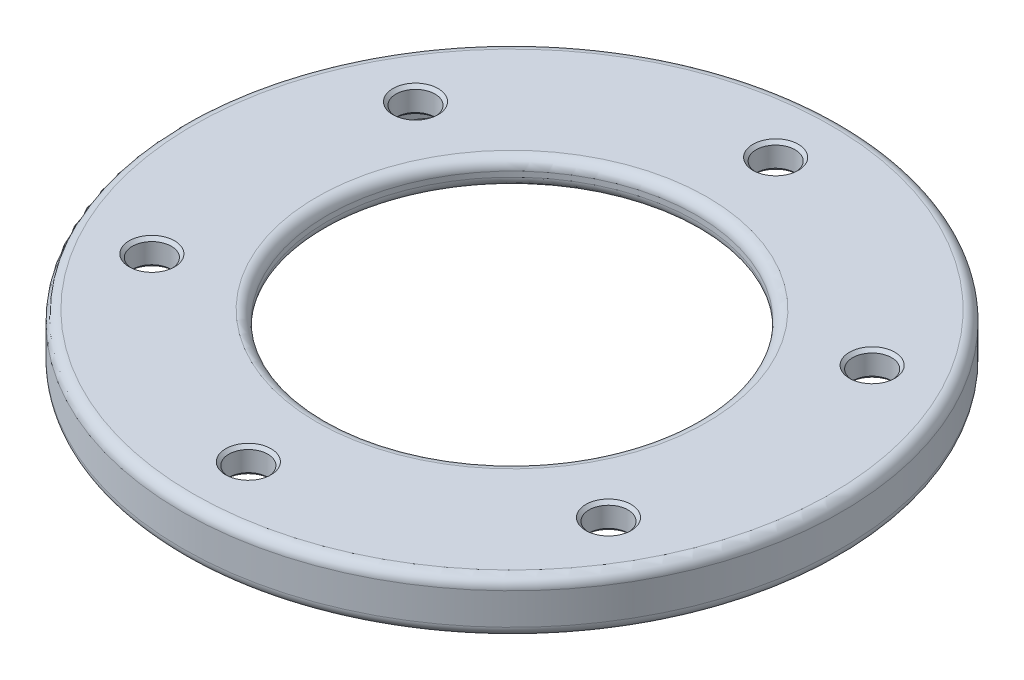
ISO-10303-21;
HEADER;
FILE_DESCRIPTION(('STEP AP214'),'2;1');
FILE_NAME('part.step','',(''),(''),'','','');
FILE_SCHEMA(('AUTOMOTIVE_DESIGN { 1 0 10303 214 1 1 1 1 }'));
ENDSEC;
DATA;
#1=APPLICATION_CONTEXT('core data for automotive mechanical design processes');
#2=APPLICATION_PROTOCOL_DEFINITION('international standard','automotive_design',2000,#1);
#3=PRODUCT_CONTEXT('',#1,'mechanical');
#4=PRODUCT('Part','Part','',(#3));
#5=PRODUCT_RELATED_PRODUCT_CATEGORY('part','',(#4));
#6=PRODUCT_DEFINITION_FORMATION('','',#4);
#7=PRODUCT_DEFINITION_CONTEXT('part definition',#1,'design');
#8=PRODUCT_DEFINITION('design','',#6,#7);
#9=PRODUCT_DEFINITION_SHAPE('','',#8);
#10=(LENGTH_UNIT() NAMED_UNIT(*) SI_UNIT(.MILLI.,.METRE.));
#11=(NAMED_UNIT(*) PLANE_ANGLE_UNIT() SI_UNIT($,.RADIAN.));
#12=(NAMED_UNIT(*) SI_UNIT($,.STERADIAN.) SOLID_ANGLE_UNIT());
#13=UNCERTAINTY_MEASURE_WITH_UNIT(LENGTH_MEASURE(1.E-05),#10,'distance_accuracy_value','');
#14=(GEOMETRIC_REPRESENTATION_CONTEXT(3) GLOBAL_UNCERTAINTY_ASSIGNED_CONTEXT((#13)) GLOBAL_UNIT_ASSIGNED_CONTEXT((#10,
#11,#12)) REPRESENTATION_CONTEXT('',''));
#15=CARTESIAN_POINT('',(0.,0.,0.));
#16=DIRECTION('',(0.,0.,1.));
#17=DIRECTION('',(1.,0.,0.));
#18=AXIS2_PLACEMENT_3D('',#15,#16,#17);
#19=CARTESIAN_POINT('',(0.,0.,0.));
#20=DIRECTION('',(0.,1.,0.));
#21=DIRECTION('',(0.,0.,1.));
#22=AXIS2_PLACEMENT_3D('',#19,#20,#21);
#23=PLANE('',#22);
#24=CARTESIAN_POINT('',(0.,0.,0.));
#25=DIRECTION('',(0.,1.,0.));
#26=DIRECTION('',(0.,0.,1.));
#27=AXIS2_PLACEMENT_3D('',#24,#25,#26);
#28=CIRCLE('',#27,23.495);
#29=CARTESIAN_POINT('',(0.,0.,23.495));
#30=VERTEX_POINT('',#29);
#31=EDGE_CURVE('E49',#30,#30,#28,.T.);
#32=ORIENTED_EDGE('',*,*,#31,.T.);
#33=EDGE_LOOP('',(#32));
#34=FACE_BOUND('',#33,.T.);
#35=CARTESIAN_POINT('',(0.,0.,-31.7499999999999));
#36=DIRECTION('',(0.,1.,0.));
#37=DIRECTION('',(0.,0.,1.));
#38=AXIS2_PLACEMENT_3D('',#35,#36,#37);
#39=CIRCLE('',#38,2.7305);
#40=CARTESIAN_POINT('',(0.,0.,-29.0194999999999));
#41=VERTEX_POINT('',#40);
#42=EDGE_CURVE('E145',#41,#41,#39,.T.);
#43=ORIENTED_EDGE('',*,*,#42,.T.);
#44=EDGE_LOOP('',(#43));
#45=FACE_BOUND('',#44,.T.);
#46=CARTESIAN_POINT('',(27.4963065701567,0.,-15.8750000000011));
#47=DIRECTION('',(0.,1.,0.));
#48=DIRECTION('',(0.,0.,1.));
#49=AXIS2_PLACEMENT_3D('',#46,#47,#48);
#50=CIRCLE('',#49,2.7305);
#51=CARTESIAN_POINT('',(27.4963065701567,0.,-13.1445000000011));
#52=VERTEX_POINT('',#51);
#53=EDGE_CURVE('E133',#52,#52,#50,.T.);
#54=ORIENTED_EDGE('',*,*,#53,.T.);
#55=EDGE_LOOP('',(#54));
#56=FACE_BOUND('',#55,.T.);
#57=CARTESIAN_POINT('',(27.496306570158,0.,15.874999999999));
#58=DIRECTION('',(0.,1.,0.));
#59=DIRECTION('',(0.,0.,1.));
#60=AXIS2_PLACEMENT_3D('',#57,#58,#59);
#61=CIRCLE('',#60,2.7305);
#62=CARTESIAN_POINT('',(27.496306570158,0.,18.605499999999));
#63=VERTEX_POINT('',#62);
#64=EDGE_CURVE('E121',#63,#63,#61,.T.);
#65=ORIENTED_EDGE('',*,*,#64,.T.);
#66=EDGE_LOOP('',(#65));
#67=FACE_BOUND('',#66,.T.);
#68=CARTESIAN_POINT('',(2.77555756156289E-12,0.,31.7500000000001));
#69=DIRECTION('',(0.,1.,0.));
#70=DIRECTION('',(0.,0.,1.));
#71=AXIS2_PLACEMENT_3D('',#68,#69,#70);
#72=CIRCLE('',#71,2.7305);
#73=CARTESIAN_POINT('',(2.77555756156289E-12,0.,34.4805000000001));
#74=VERTEX_POINT('',#73);
#75=EDGE_CURVE('E109',#74,#74,#72,.T.);
#76=ORIENTED_EDGE('',*,*,#75,.T.);
#77=EDGE_LOOP('',(#76));
#78=FACE_BOUND('',#77,.T.);
#79=CARTESIAN_POINT('',(-27.4963065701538,0.,15.8750000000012));
#80=DIRECTION('',(0.,1.,0.));
#81=DIRECTION('',(0.,0.,1.));
#82=AXIS2_PLACEMENT_3D('',#79,#80,#81);
#83=CIRCLE('',#82,2.7305);
#84=CARTESIAN_POINT('',(-27.4963065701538,0.,18.6055000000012));
#85=VERTEX_POINT('',#84);
#86=EDGE_CURVE('E97',#85,#85,#83,.T.);
#87=ORIENTED_EDGE('',*,*,#86,.T.);
#88=EDGE_LOOP('',(#87));
#89=FACE_BOUND('',#88,.T.);
#90=CARTESIAN_POINT('',(-27.4963065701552,0.,-15.8749999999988));
#91=DIRECTION('',(0.,1.,0.));
#92=DIRECTION('',(0.,0.,1.));
#93=AXIS2_PLACEMENT_3D('',#90,#91,#92);
#94=CIRCLE('',#93,2.7305);
#95=CARTESIAN_POINT('',(-27.4963065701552,0.,-13.1444999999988));
#96=VERTEX_POINT('',#95);
#97=EDGE_CURVE('E85',#96,#96,#94,.T.);
#98=ORIENTED_EDGE('',*,*,#97,.T.);
#99=EDGE_LOOP('',(#98));
#100=FACE_BOUND('',#99,.T.);
#101=CARTESIAN_POINT('',(0.,0.,0.));
#102=DIRECTION('',(0.,-1.,0.));
#103=DIRECTION('',(0.,0.,-1.));
#104=AXIS2_PLACEMENT_3D('',#101,#102,#103);
#105=CIRCLE('',#104,37.9095);
#106=CARTESIAN_POINT('',(0.,0.,-37.9095));
#107=VERTEX_POINT('',#106);
#108=EDGE_CURVE('E71',#107,#107,#105,.T.);
#109=ORIENTED_EDGE('',*,*,#108,.T.);
#110=EDGE_LOOP('',(#109));
#111=FACE_BOUND('',#110,.T.);
#112=ADVANCED_FACE('F38',(#34,#45,#56,#67,#78,#89,#100,#111),#23,.F.);
#113=CARTESIAN_POINT('',(0.,3.17500000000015,0.));
#114=DIRECTION('',(0.,1.,0.));
#115=DIRECTION('',(0.,0.,1.));
#116=AXIS2_PLACEMENT_3D('',#113,#114,#115);
#117=PLANE('',#116);
#118=CARTESIAN_POINT('',(0.,3.17500000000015,0.));
#119=DIRECTION('',(0.,1.,0.));
#120=DIRECTION('',(0.,0.,1.));
#121=AXIS2_PLACEMENT_3D('',#118,#119,#120);
#122=CIRCLE('',#121,38.4175);
#123=CARTESIAN_POINT('',(0.,3.17500000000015,38.4175));
#124=VERTEX_POINT('',#123);
#125=EDGE_CURVE('E53',#124,#124,#122,.T.);
#126=ORIENTED_EDGE('',*,*,#125,.T.);
#127=EDGE_LOOP('',(#126));
#128=FACE_BOUND('',#127,.T.);
#129=CARTESIAN_POINT('',(0.,3.17500000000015,0.));
#130=DIRECTION('',(0.,1.,0.));
#131=DIRECTION('',(0.,0.,1.));
#132=AXIS2_PLACEMENT_3D('',#129,#130,#131);
#133=CIRCLE('',#132,23.495);
#134=CARTESIAN_POINT('',(0.,3.17500000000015,23.495));
#135=VERTEX_POINT('',#134);
#136=EDGE_CURVE('E58',#135,#135,#133,.F.);
#137=ORIENTED_EDGE('',*,*,#136,.T.);
#138=EDGE_LOOP('',(#137));
#139=FACE_BOUND('',#138,.T.);
#140=CARTESIAN_POINT('',(0.,3.17500000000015,-31.7499999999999));
#141=DIRECTION('',(0.,1.,0.));
#142=DIRECTION('',(0.,0.,1.));
#143=AXIS2_PLACEMENT_3D('',#140,#141,#142);
#144=CIRCLE('',#143,2.7305);
#145=CARTESIAN_POINT('',(0.,3.17500000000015,-29.0194999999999));
#146=VERTEX_POINT('',#145);
#147=EDGE_CURVE('E142',#146,#146,#144,.T.);
#148=ORIENTED_EDGE('',*,*,#147,.F.);
#149=EDGE_LOOP('',(#148));
#150=FACE_BOUND('',#149,.T.);
#151=CARTESIAN_POINT('',(27.4963065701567,3.17500000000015,-15.8750000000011));
#152=DIRECTION('',(0.,1.,0.));
#153=DIRECTION('',(0.,0.,1.));
#154=AXIS2_PLACEMENT_3D('',#151,#152,#153);
#155=CIRCLE('',#154,2.7305);
#156=CARTESIAN_POINT('',(27.4963065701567,3.17500000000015,-13.1445000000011));
#157=VERTEX_POINT('',#156);
#158=EDGE_CURVE('E130',#157,#157,#155,.T.);
#159=ORIENTED_EDGE('',*,*,#158,.F.);
#160=EDGE_LOOP('',(#159));
#161=FACE_BOUND('',#160,.T.);
#162=CARTESIAN_POINT('',(27.496306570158,3.17500000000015,15.874999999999));
#163=DIRECTION('',(0.,1.,0.));
#164=DIRECTION('',(0.,0.,1.));
#165=AXIS2_PLACEMENT_3D('',#162,#163,#164);
#166=CIRCLE('',#165,2.7305);
#167=CARTESIAN_POINT('',(27.496306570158,3.17500000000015,18.605499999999));
#168=VERTEX_POINT('',#167);
#169=EDGE_CURVE('E118',#168,#168,#166,.T.);
#170=ORIENTED_EDGE('',*,*,#169,.F.);
#171=EDGE_LOOP('',(#170));
#172=FACE_BOUND('',#171,.T.);
#173=CARTESIAN_POINT('',(2.77555756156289E-12,3.17500000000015,31.7500000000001));
#174=DIRECTION('',(0.,1.,0.));
#175=DIRECTION('',(0.,0.,1.));
#176=AXIS2_PLACEMENT_3D('',#173,#174,#175);
#177=CIRCLE('',#176,2.7305);
#178=CARTESIAN_POINT('',(2.77555756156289E-12,3.17500000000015,34.4805000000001));
#179=VERTEX_POINT('',#178);
#180=EDGE_CURVE('E106',#179,#179,#177,.T.);
#181=ORIENTED_EDGE('',*,*,#180,.F.);
#182=EDGE_LOOP('',(#181));
#183=FACE_BOUND('',#182,.T.);
#184=CARTESIAN_POINT('',(-27.4963065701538,3.17500000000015,15.8750000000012));
#185=DIRECTION('',(0.,1.,0.));
#186=DIRECTION('',(0.,0.,1.));
#187=AXIS2_PLACEMENT_3D('',#184,#185,#186);
#188=CIRCLE('',#187,2.7305);
#189=CARTESIAN_POINT('',(-27.4963065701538,3.17500000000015,18.6055000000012));
#190=VERTEX_POINT('',#189);
#191=EDGE_CURVE('E94',#190,#190,#188,.T.);
#192=ORIENTED_EDGE('',*,*,#191,.F.);
#193=EDGE_LOOP('',(#192));
#194=FACE_BOUND('',#193,.T.);
#195=CARTESIAN_POINT('',(-27.4963065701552,3.17500000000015,-15.8749999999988));
#196=DIRECTION('',(0.,1.,0.));
#197=DIRECTION('',(0.,0.,1.));
#198=AXIS2_PLACEMENT_3D('',#195,#196,#197);
#199=CIRCLE('',#198,2.7305);
#200=CARTESIAN_POINT('',(-27.4963065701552,3.17500000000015,-13.1444999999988));
#201=VERTEX_POINT('',#200);
#202=EDGE_CURVE('E82',#201,#201,#199,.T.);
#203=ORIENTED_EDGE('',*,*,#202,.F.);
#204=EDGE_LOOP('',(#203));
#205=FACE_BOUND('',#204,.T.);
#206=ADVANCED_FACE('F171',(#128,#139,#150,#161,#172,#183,#194,#205),#117,.T.);
#207=CARTESIAN_POINT('',(0.,3.17500000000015,0.));
#208=DIRECTION('',(0.,-1.,0.));
#209=DIRECTION('',(0.,0.,-1.));
#210=AXIS2_PLACEMENT_3D('',#207,#208,#209);
#211=CYLINDRICAL_SURFACE('',#210,39.6875);
#212=CARTESIAN_POINT('',(0.,-1.90499999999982,0.));
#213=DIRECTION('',(0.,-1.,0.));
#214=DIRECTION('',(0.,0.,-1.));
#215=AXIS2_PLACEMENT_3D('',#212,#213,#214);
#216=CIRCLE('',#215,39.6875);
#217=CARTESIAN_POINT('',(0.,-1.90499999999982,-39.6875));
#218=VERTEX_POINT('',#217);
#219=EDGE_CURVE('E61',#218,#218,#216,.F.);
#220=ORIENTED_EDGE('',*,*,#219,.T.);
#221=EDGE_LOOP('',(#220));
#222=FACE_BOUND('',#221,.T.);
#223=CARTESIAN_POINT('',(0.,1.90499999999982,0.));
#224=DIRECTION('',(0.,1.,0.));
#225=DIRECTION('',(0.,0.,1.));
#226=AXIS2_PLACEMENT_3D('',#223,#224,#225);
#227=CIRCLE('',#226,39.6875);
#228=CARTESIAN_POINT('',(0.,1.90499999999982,39.6875));
#229=VERTEX_POINT('',#228);
#230=EDGE_CURVE('E64',#229,#229,#227,.F.);
#231=ORIENTED_EDGE('',*,*,#230,.T.);
#232=EDGE_LOOP('',(#231));
#233=FACE_BOUND('',#232,.T.);
#234=ADVANCED_FACE('F174',(#222,#233),#211,.T.);
#235=CARTESIAN_POINT('',(0.,3.17500000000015,0.));
#236=DIRECTION('',(0.,-1.,0.));
#237=DIRECTION('',(0.,0.,-1.));
#238=AXIS2_PLACEMENT_3D('',#235,#236,#237);
#239=CYLINDRICAL_SURFACE('',#238,22.225);
#240=CARTESIAN_POINT('',(0.,1.26999999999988,0.));
#241=DIRECTION('',(0.,1.,0.));
#242=DIRECTION('',(0.,0.,1.));
#243=AXIS2_PLACEMENT_3D('',#240,#241,#242);
#244=CIRCLE('',#243,22.225);
#245=CARTESIAN_POINT('',(0.,1.26999999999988,22.225));
#246=VERTEX_POINT('',#245);
#247=EDGE_CURVE('E10',#246,#246,#244,.F.);
#248=ORIENTED_EDGE('',*,*,#247,.T.);
#249=EDGE_LOOP('',(#248));
#250=FACE_BOUND('',#249,.T.);
#251=CARTESIAN_POINT('',(0.,1.90499999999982,0.));
#252=DIRECTION('',(0.,1.,0.));
#253=DIRECTION('',(0.,0.,1.));
#254=AXIS2_PLACEMENT_3D('',#251,#252,#253);
#255=CIRCLE('',#254,22.225);
#256=CARTESIAN_POINT('',(0.,1.90499999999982,22.225));
#257=VERTEX_POINT('',#256);
#258=EDGE_CURVE('E45',#257,#257,#255,.T.);
#259=ORIENTED_EDGE('',*,*,#258,.T.);
#260=EDGE_LOOP('',(#259));
#261=FACE_BOUND('',#260,.T.);
#262=ADVANCED_FACE('F213',(#250,#261),#239,.F.);
#263=CARTESIAN_POINT('',(0.,-3.17500000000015,0.));
#264=DIRECTION('',(0.,-1.,0.));
#265=DIRECTION('',(0.,0.,-1.));
#266=AXIS2_PLACEMENT_3D('',#263,#264,#265);
#267=PLANE('',#266);
#268=CARTESIAN_POINT('',(0.,-3.17500000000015,0.));
#269=DIRECTION('',(0.,-1.,0.));
#270=DIRECTION('',(0.,0.,-1.));
#271=AXIS2_PLACEMENT_3D('',#268,#269,#270);
#272=CIRCLE('',#271,38.4175);
#273=CARTESIAN_POINT('',(0.,-3.17500000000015,-38.4175));
#274=VERTEX_POINT('',#273);
#275=EDGE_CURVE('E67',#274,#274,#272,.T.);
#276=ORIENTED_EDGE('',*,*,#275,.T.);
#277=EDGE_LOOP('',(#276));
#278=FACE_BOUND('',#277,.T.);
#279=CARTESIAN_POINT('',(0.,-3.17500000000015,0.));
#280=DIRECTION('',(0.,-1.,0.));
#281=DIRECTION('',(0.,0.,-1.));
#282=AXIS2_PLACEMENT_3D('',#279,#280,#281);
#283=CIRCLE('',#282,37.9095);
#284=CARTESIAN_POINT('',(0.,-3.17500000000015,-37.9095));
#285=VERTEX_POINT('',#284);
#286=EDGE_CURVE('E70',#285,#285,#283,.T.);
#287=ORIENTED_EDGE('',*,*,#286,.F.);
#288=EDGE_LOOP('',(#287));
#289=FACE_BOUND('',#288,.T.);
#290=ADVANCED_FACE('F412',(#278,#289),#267,.T.);
#291=CARTESIAN_POINT('',(0.,-3.17500000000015,0.));
#292=DIRECTION('',(0.,1.,0.));
#293=DIRECTION('',(0.,0.,1.));
#294=AXIS2_PLACEMENT_3D('',#291,#292,#293);
#295=CYLINDRICAL_SURFACE('',#294,37.9095);
#296=ORIENTED_EDGE('',*,*,#286,.T.);
#297=EDGE_LOOP('',(#296));
#298=FACE_BOUND('',#297,.T.);
#299=ORIENTED_EDGE('',*,*,#108,.F.);
#300=EDGE_LOOP('',(#299));
#301=FACE_BOUND('',#300,.T.);
#302=ADVANCED_FACE('F402',(#298,#301),#295,.F.);
#303=CARTESIAN_POINT('',(-27.4963065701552,0.380999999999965,-15.8749999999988));
#304=DIRECTION('',(0.,-1.,0.));
#305=DIRECTION('',(0.,0.,-1.));
#306=AXIS2_PLACEMENT_3D('',#303,#304,#305);
#307=CONICAL_SURFACE('',#306,2.3495,0.785398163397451);
#308=ORIENTED_EDGE('',*,*,#97,.F.);
#309=EDGE_LOOP('',(#308));
#310=FACE_BOUND('',#309,.T.);
#311=CARTESIAN_POINT('',(-27.4963065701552,0.380999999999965,-15.8749999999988));
#312=DIRECTION('',(0.,1.,0.));
#313=DIRECTION('',(0.,0.,1.));
#314=AXIS2_PLACEMENT_3D('',#311,#312,#313);
#315=CIRCLE('',#314,2.3495);
#316=CARTESIAN_POINT('',(-27.4963065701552,0.380999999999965,-13.5254999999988));
#317=VERTEX_POINT('',#316);
#318=EDGE_CURVE('E74',#317,#317,#315,.T.);
#319=ORIENTED_EDGE('',*,*,#318,.T.);
#320=EDGE_LOOP('',(#319));
#321=FACE_BOUND('',#320,.T.);
#322=ADVANCED_FACE('F200',(#310,#321),#307,.F.);
#323=CARTESIAN_POINT('',(-27.4963065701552,3.17500000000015,-15.8749999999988));
#324=DIRECTION('',(0.,1.,0.));
#325=DIRECTION('',(0.,0.,1.));
#326=AXIS2_PLACEMENT_3D('',#323,#324,#325);
#327=CYLINDRICAL_SURFACE('',#326,2.3495);
#328=ORIENTED_EDGE('',*,*,#318,.F.);
#329=EDGE_LOOP('',(#328));
#330=FACE_BOUND('',#329,.T.);
#331=CARTESIAN_POINT('',(-27.4963065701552,2.79400000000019,-15.8749999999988));
#332=DIRECTION('',(0.,1.,0.));
#333=DIRECTION('',(0.,0.,1.));
#334=AXIS2_PLACEMENT_3D('',#331,#332,#333);
#335=CIRCLE('',#334,2.3495);
#336=CARTESIAN_POINT('',(-27.4963065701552,2.79400000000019,-13.5254999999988));
#337=VERTEX_POINT('',#336);
#338=EDGE_CURVE('E79',#337,#337,#335,.T.);
#339=ORIENTED_EDGE('',*,*,#338,.T.);
#340=EDGE_LOOP('',(#339));
#341=FACE_BOUND('',#340,.T.);
#342=ADVANCED_FACE('F190',(#330,#341),#327,.F.);
#343=CARTESIAN_POINT('',(-27.4963065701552,3.17500000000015,-15.8749999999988));
#344=DIRECTION('',(0.,1.,0.));
#345=DIRECTION('',(0.,0.,1.));
#346=AXIS2_PLACEMENT_3D('',#343,#344,#345);
#347=CONICAL_SURFACE('',#346,2.7305,0.785398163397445);
#348=ORIENTED_EDGE('',*,*,#338,.F.);
#349=EDGE_LOOP('',(#348));
#350=FACE_BOUND('',#349,.T.);
#351=ORIENTED_EDGE('',*,*,#202,.T.);
#352=EDGE_LOOP('',(#351));
#353=FACE_BOUND('',#352,.T.);
#354=ADVANCED_FACE('F187',(#350,#353),#347,.F.);
#355=CARTESIAN_POINT('',(-27.4963065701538,0.380999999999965,15.8750000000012));
#356=DIRECTION('',(0.,-1.,0.));
#357=DIRECTION('',(0.,0.,-1.));
#358=AXIS2_PLACEMENT_3D('',#355,#356,#357);
#359=CONICAL_SURFACE('',#358,2.3495,0.785398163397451);
#360=ORIENTED_EDGE('',*,*,#86,.F.);
#361=EDGE_LOOP('',(#360));
#362=FACE_BOUND('',#361,.T.);
#363=CARTESIAN_POINT('',(-27.4963065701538,0.380999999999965,15.8750000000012));
#364=DIRECTION('',(0.,1.,0.));
#365=DIRECTION('',(0.,0.,1.));
#366=AXIS2_PLACEMENT_3D('',#363,#364,#365);
#367=CIRCLE('',#366,2.3495);
#368=CARTESIAN_POINT('',(-27.4963065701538,0.380999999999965,18.2245000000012));
#369=VERTEX_POINT('',#368);
#370=EDGE_CURVE('E88',#369,#369,#367,.T.);
#371=ORIENTED_EDGE('',*,*,#370,.T.);
#372=EDGE_LOOP('',(#371));
#373=FACE_BOUND('',#372,.T.);
#374=ADVANCED_FACE('F189',(#362,#373),#359,.F.);
#375=CARTESIAN_POINT('',(-27.4963065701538,3.17500000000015,15.8750000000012));
#376=DIRECTION('',(0.,1.,0.));
#377=DIRECTION('',(0.,0.,1.));
#378=AXIS2_PLACEMENT_3D('',#375,#376,#377);
#379=CYLINDRICAL_SURFACE('',#378,2.3495);
#380=ORIENTED_EDGE('',*,*,#370,.F.);
#381=EDGE_LOOP('',(#380));
#382=FACE_BOUND('',#381,.T.);
#383=CARTESIAN_POINT('',(-27.4963065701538,2.79400000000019,15.8750000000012));
#384=DIRECTION('',(0.,1.,0.));
#385=DIRECTION('',(0.,0.,1.));
#386=AXIS2_PLACEMENT_3D('',#383,#384,#385);
#387=CIRCLE('',#386,2.3495);
#388=CARTESIAN_POINT('',(-27.4963065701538,2.79400000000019,18.2245000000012));
#389=VERTEX_POINT('',#388);
#390=EDGE_CURVE('E91',#389,#389,#387,.T.);
#391=ORIENTED_EDGE('',*,*,#390,.T.);
#392=EDGE_LOOP('',(#391));
#393=FACE_BOUND('',#392,.T.);
#394=ADVANCED_FACE('F197',(#382,#393),#379,.F.);
#395=CARTESIAN_POINT('',(-27.4963065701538,3.17500000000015,15.8750000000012));
#396=DIRECTION('',(0.,1.,0.));
#397=DIRECTION('',(0.,0.,1.));
#398=AXIS2_PLACEMENT_3D('',#395,#396,#397);
#399=CONICAL_SURFACE('',#398,2.7305,0.785398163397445);
#400=ORIENTED_EDGE('',*,*,#390,.F.);
#401=EDGE_LOOP('',(#400));
#402=FACE_BOUND('',#401,.T.);
#403=ORIENTED_EDGE('',*,*,#191,.T.);
#404=EDGE_LOOP('',(#403));
#405=FACE_BOUND('',#404,.T.);
#406=ADVANCED_FACE('F358',(#402,#405),#399,.F.);
#407=CARTESIAN_POINT('',(2.77555756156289E-12,0.380999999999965,31.7500000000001));
#408=DIRECTION('',(0.,-1.,0.));
#409=DIRECTION('',(0.,0.,-1.));
#410=AXIS2_PLACEMENT_3D('',#407,#408,#409);
#411=CONICAL_SURFACE('',#410,2.3495,0.785398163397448);
#412=ORIENTED_EDGE('',*,*,#75,.F.);
#413=EDGE_LOOP('',(#412));
#414=FACE_BOUND('',#413,.T.);
#415=CARTESIAN_POINT('',(2.77555756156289E-12,0.380999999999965,31.7500000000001));
#416=DIRECTION('',(0.,1.,0.));
#417=DIRECTION('',(0.,0.,1.));
#418=AXIS2_PLACEMENT_3D('',#415,#416,#417);
#419=CIRCLE('',#418,2.3495);
#420=CARTESIAN_POINT('',(2.77555756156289E-12,0.380999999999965,34.0995000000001));
#421=VERTEX_POINT('',#420);
#422=EDGE_CURVE('E100',#421,#421,#419,.T.);
#423=ORIENTED_EDGE('',*,*,#422,.T.);
#424=EDGE_LOOP('',(#423));
#425=FACE_BOUND('',#424,.T.);
#426=ADVANCED_FACE('F348',(#414,#425),#411,.F.);
#427=CARTESIAN_POINT('',(2.77555756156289E-12,3.17500000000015,31.7500000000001));
#428=DIRECTION('',(0.,1.,0.));
#429=DIRECTION('',(0.,0.,1.));
#430=AXIS2_PLACEMENT_3D('',#427,#428,#429);
#431=CYLINDRICAL_SURFACE('',#430,2.3495);
#432=ORIENTED_EDGE('',*,*,#422,.F.);
#433=EDGE_LOOP('',(#432));
#434=FACE_BOUND('',#433,.T.);
#435=CARTESIAN_POINT('',(2.77555756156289E-12,2.79400000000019,31.7500000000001));
#436=DIRECTION('',(0.,1.,0.));
#437=DIRECTION('',(0.,0.,1.));
#438=AXIS2_PLACEMENT_3D('',#435,#436,#437);
#439=CIRCLE('',#438,2.3495);
#440=CARTESIAN_POINT('',(2.77555756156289E-12,2.79400000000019,34.0995000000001));
#441=VERTEX_POINT('',#440);
#442=EDGE_CURVE('E103',#441,#441,#439,.T.);
#443=ORIENTED_EDGE('',*,*,#442,.T.);
#444=EDGE_LOOP('',(#443));
#445=FACE_BOUND('',#444,.T.);
#446=ADVANCED_FACE('F338',(#434,#445),#431,.F.);
#447=CARTESIAN_POINT('',(2.77555756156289E-12,3.17500000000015,31.7500000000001));
#448=DIRECTION('',(0.,1.,0.));
#449=DIRECTION('',(0.,0.,1.));
#450=AXIS2_PLACEMENT_3D('',#447,#448,#449);
#451=CONICAL_SURFACE('',#450,2.7305,0.785398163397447);
#452=ORIENTED_EDGE('',*,*,#442,.F.);
#453=EDGE_LOOP('',(#452));
#454=FACE_BOUND('',#453,.T.);
#455=ORIENTED_EDGE('',*,*,#180,.T.);
#456=EDGE_LOOP('',(#455));
#457=FACE_BOUND('',#456,.T.);
#458=ADVANCED_FACE('F328',(#454,#457),#451,.F.);
#459=CARTESIAN_POINT('',(27.496306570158,0.380999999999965,15.874999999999));
#460=DIRECTION('',(0.,-1.,0.));
#461=DIRECTION('',(0.,0.,-1.));
#462=AXIS2_PLACEMENT_3D('',#459,#460,#461);
#463=CONICAL_SURFACE('',#462,2.3495,0.785398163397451);
#464=ORIENTED_EDGE('',*,*,#64,.F.);
#465=EDGE_LOOP('',(#464));
#466=FACE_BOUND('',#465,.T.);
#467=CARTESIAN_POINT('',(27.496306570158,0.380999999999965,15.874999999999));
#468=DIRECTION('',(0.,1.,0.));
#469=DIRECTION('',(0.,0.,1.));
#470=AXIS2_PLACEMENT_3D('',#467,#468,#469);
#471=CIRCLE('',#470,2.3495);
#472=CARTESIAN_POINT('',(27.496306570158,0.380999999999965,18.224499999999));
#473=VERTEX_POINT('',#472);
#474=EDGE_CURVE('E112',#473,#473,#471,.T.);
#475=ORIENTED_EDGE('',*,*,#474,.T.);
#476=EDGE_LOOP('',(#475));
#477=FACE_BOUND('',#476,.T.);
#478=ADVANCED_FACE('F318',(#466,#477),#463,.F.);
#479=CARTESIAN_POINT('',(27.496306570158,3.17500000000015,15.874999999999));
#480=DIRECTION('',(0.,1.,0.));
#481=DIRECTION('',(0.,0.,1.));
#482=AXIS2_PLACEMENT_3D('',#479,#480,#481);
#483=CYLINDRICAL_SURFACE('',#482,2.3495);
#484=ORIENTED_EDGE('',*,*,#474,.F.);
#485=EDGE_LOOP('',(#484));
#486=FACE_BOUND('',#485,.T.);
#487=CARTESIAN_POINT('',(27.496306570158,2.79400000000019,15.874999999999));
#488=DIRECTION('',(0.,1.,0.));
#489=DIRECTION('',(0.,0.,1.));
#490=AXIS2_PLACEMENT_3D('',#487,#488,#489);
#491=CIRCLE('',#490,2.3495);
#492=CARTESIAN_POINT('',(27.496306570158,2.79400000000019,18.224499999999));
#493=VERTEX_POINT('',#492);
#494=EDGE_CURVE('E115',#493,#493,#491,.T.);
#495=ORIENTED_EDGE('',*,*,#494,.T.);
#496=EDGE_LOOP('',(#495));
#497=FACE_BOUND('',#496,.T.);
#498=ADVANCED_FACE('F308',(#486,#497),#483,.F.);
#499=CARTESIAN_POINT('',(27.496306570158,3.17500000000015,15.874999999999));
#500=DIRECTION('',(0.,1.,0.));
#501=DIRECTION('',(0.,0.,1.));
#502=AXIS2_PLACEMENT_3D('',#499,#500,#501);
#503=CONICAL_SURFACE('',#502,2.7305,0.785398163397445);
#504=ORIENTED_EDGE('',*,*,#494,.F.);
#505=EDGE_LOOP('',(#504));
#506=FACE_BOUND('',#505,.T.);
#507=ORIENTED_EDGE('',*,*,#169,.T.);
#508=EDGE_LOOP('',(#507));
#509=FACE_BOUND('',#508,.T.);
#510=ADVANCED_FACE('F298',(#506,#509),#503,.F.);
#511=CARTESIAN_POINT('',(27.4963065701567,0.380999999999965,-15.8750000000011));
#512=DIRECTION('',(0.,-1.,0.));
#513=DIRECTION('',(0.,0.,-1.));
#514=AXIS2_PLACEMENT_3D('',#511,#512,#513);
#515=CONICAL_SURFACE('',#514,2.3495,0.785398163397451);
#516=ORIENTED_EDGE('',*,*,#53,.F.);
#517=EDGE_LOOP('',(#516));
#518=FACE_BOUND('',#517,.T.);
#519=CARTESIAN_POINT('',(27.4963065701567,0.380999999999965,-15.8750000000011));
#520=DIRECTION('',(0.,1.,0.));
#521=DIRECTION('',(0.,0.,1.));
#522=AXIS2_PLACEMENT_3D('',#519,#520,#521);
#523=CIRCLE('',#522,2.3495);
#524=CARTESIAN_POINT('',(27.4963065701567,0.380999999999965,-13.5255000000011));
#525=VERTEX_POINT('',#524);
#526=EDGE_CURVE('E124',#525,#525,#523,.T.);
#527=ORIENTED_EDGE('',*,*,#526,.T.);
#528=EDGE_LOOP('',(#527));
#529=FACE_BOUND('',#528,.T.);
#530=ADVANCED_FACE('F288',(#518,#529),#515,.F.);
#531=CARTESIAN_POINT('',(27.4963065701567,3.17500000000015,-15.8750000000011));
#532=DIRECTION('',(0.,1.,0.));
#533=DIRECTION('',(0.,0.,1.));
#534=AXIS2_PLACEMENT_3D('',#531,#532,#533);
#535=CYLINDRICAL_SURFACE('',#534,2.3495);
#536=ORIENTED_EDGE('',*,*,#526,.F.);
#537=EDGE_LOOP('',(#536));
#538=FACE_BOUND('',#537,.T.);
#539=CARTESIAN_POINT('',(27.4963065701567,2.79400000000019,-15.8750000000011));
#540=DIRECTION('',(0.,1.,0.));
#541=DIRECTION('',(0.,0.,1.));
#542=AXIS2_PLACEMENT_3D('',#539,#540,#541);
#543=CIRCLE('',#542,2.3495);
#544=CARTESIAN_POINT('',(27.4963065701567,2.79400000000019,-13.5255000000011));
#545=VERTEX_POINT('',#544);
#546=EDGE_CURVE('E127',#545,#545,#543,.T.);
#547=ORIENTED_EDGE('',*,*,#546,.T.);
#548=EDGE_LOOP('',(#547));
#549=FACE_BOUND('',#548,.T.);
#550=ADVANCED_FACE('F278',(#538,#549),#535,.F.);
#551=CARTESIAN_POINT('',(27.4963065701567,3.17500000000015,-15.8750000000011));
#552=DIRECTION('',(0.,1.,0.));
#553=DIRECTION('',(0.,0.,1.));
#554=AXIS2_PLACEMENT_3D('',#551,#552,#553);
#555=CONICAL_SURFACE('',#554,2.7305,0.785398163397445);
#556=ORIENTED_EDGE('',*,*,#546,.F.);
#557=EDGE_LOOP('',(#556));
#558=FACE_BOUND('',#557,.T.);
#559=ORIENTED_EDGE('',*,*,#158,.T.);
#560=EDGE_LOOP('',(#559));
#561=FACE_BOUND('',#560,.T.);
#562=ADVANCED_FACE('F155',(#558,#561),#555,.F.);
#563=CARTESIAN_POINT('',(0.,0.380999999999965,-31.7499999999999));
#564=DIRECTION('',(0.,-1.,0.));
#565=DIRECTION('',(0.,0.,-1.));
#566=AXIS2_PLACEMENT_3D('',#563,#564,#565);
#567=CONICAL_SURFACE('',#566,2.3495,0.785398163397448);
#568=ORIENTED_EDGE('',*,*,#42,.F.);
#569=EDGE_LOOP('',(#568));
#570=FACE_BOUND('',#569,.T.);
#571=CARTESIAN_POINT('',(0.,0.380999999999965,-31.7499999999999));
#572=DIRECTION('',(0.,1.,0.));
#573=DIRECTION('',(0.,0.,1.));
#574=AXIS2_PLACEMENT_3D('',#571,#572,#573);
#575=CIRCLE('',#574,2.3495);
#576=CARTESIAN_POINT('',(0.,0.380999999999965,-29.4004999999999));
#577=VERTEX_POINT('',#576);
#578=EDGE_CURVE('E136',#577,#577,#575,.T.);
#579=ORIENTED_EDGE('',*,*,#578,.T.);
#580=EDGE_LOOP('',(#579));
#581=FACE_BOUND('',#580,.T.);
#582=ADVANCED_FACE('F151',(#570,#581),#567,.F.);
#583=CARTESIAN_POINT('',(0.,3.17500000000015,-31.7499999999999));
#584=DIRECTION('',(0.,1.,0.));
#585=DIRECTION('',(0.,0.,1.));
#586=AXIS2_PLACEMENT_3D('',#583,#584,#585);
#587=CYLINDRICAL_SURFACE('',#586,2.3495);
#588=ORIENTED_EDGE('',*,*,#578,.F.);
#589=EDGE_LOOP('',(#588));
#590=FACE_BOUND('',#589,.T.);
#591=CARTESIAN_POINT('',(0.,2.79400000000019,-31.7499999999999));
#592=DIRECTION('',(0.,1.,0.));
#593=DIRECTION('',(0.,0.,1.));
#594=AXIS2_PLACEMENT_3D('',#591,#592,#593);
#595=CIRCLE('',#594,2.3495);
#596=CARTESIAN_POINT('',(0.,2.79400000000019,-29.4004999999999));
#597=VERTEX_POINT('',#596);
#598=EDGE_CURVE('E139',#597,#597,#595,.T.);
#599=ORIENTED_EDGE('',*,*,#598,.T.);
#600=EDGE_LOOP('',(#599));
#601=FACE_BOUND('',#600,.T.);
#602=ADVANCED_FACE('F154',(#590,#601),#587,.F.);
#603=CARTESIAN_POINT('',(0.,3.17500000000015,-31.7499999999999));
#604=DIRECTION('',(0.,1.,0.));
#605=DIRECTION('',(0.,0.,1.));
#606=AXIS2_PLACEMENT_3D('',#603,#604,#605);
#607=CONICAL_SURFACE('',#606,2.7305,0.785398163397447);
#608=ORIENTED_EDGE('',*,*,#598,.F.);
#609=EDGE_LOOP('',(#608));
#610=FACE_BOUND('',#609,.T.);
#611=ORIENTED_EDGE('',*,*,#147,.T.);
#612=EDGE_LOOP('',(#611));
#613=FACE_BOUND('',#612,.T.);
#614=ADVANCED_FACE('F161',(#610,#613),#607,.F.);
#615=CARTESIAN_POINT('',(0.,-1.90499999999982,0.));
#616=DIRECTION('',(0.,-1.,0.));
#617=DIRECTION('',(0.,0.,-1.));
#618=AXIS2_PLACEMENT_3D('',#615,#616,#617);
#619=TOROIDAL_SURFACE('',#618,38.4175,1.27);
#620=ORIENTED_EDGE('',*,*,#219,.F.);
#621=EDGE_LOOP('',(#620));
#622=FACE_BOUND('',#621,.T.);
#623=ORIENTED_EDGE('',*,*,#275,.F.);
#624=EDGE_LOOP('',(#623));
#625=FACE_BOUND('',#624,.T.);
#626=ADVANCED_FACE('F167',(#622,#625),#619,.T.);
#627=CARTESIAN_POINT('',(0.,1.90499999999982,0.));
#628=DIRECTION('',(0.,1.,0.));
#629=DIRECTION('',(0.,0.,1.));
#630=AXIS2_PLACEMENT_3D('',#627,#628,#629);
#631=TOROIDAL_SURFACE('',#630,38.4175,1.27);
#632=ORIENTED_EDGE('',*,*,#230,.F.);
#633=EDGE_LOOP('',(#632));
#634=FACE_BOUND('',#633,.T.);
#635=ORIENTED_EDGE('',*,*,#125,.F.);
#636=EDGE_LOOP('',(#635));
#637=FACE_BOUND('',#636,.T.);
#638=ADVANCED_FACE('F217',(#634,#637),#631,.T.);
#639=CARTESIAN_POINT('',(0.,1.26999999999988,0.));
#640=DIRECTION('',(0.,1.,0.));
#641=DIRECTION('',(0.,0.,1.));
#642=AXIS2_PLACEMENT_3D('',#639,#640,#641);
#643=TOROIDAL_SURFACE('',#642,23.495,1.27);
#644=ORIENTED_EDGE('',*,*,#247,.F.);
#645=EDGE_LOOP('',(#644));
#646=FACE_BOUND('',#645,.T.);
#647=ORIENTED_EDGE('',*,*,#31,.F.);
#648=EDGE_LOOP('',(#647));
#649=FACE_BOUND('',#648,.T.);
#650=ADVANCED_FACE('F220',(#646,#649),#643,.T.);
#651=CARTESIAN_POINT('',(0.,1.90499999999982,0.));
#652=DIRECTION('',(0.,1.,0.));
#653=DIRECTION('',(0.,0.,1.));
#654=AXIS2_PLACEMENT_3D('',#651,#652,#653);
#655=TOROIDAL_SURFACE('',#654,23.495,1.27);
#656=ORIENTED_EDGE('',*,*,#136,.F.);
#657=EDGE_LOOP('',(#656));
#658=FACE_BOUND('',#657,.T.);
#659=ORIENTED_EDGE('',*,*,#258,.F.);
#660=EDGE_LOOP('',(#659));
#661=FACE_BOUND('',#660,.T.);
#662=ADVANCED_FACE('F40',(#658,#661),#655,.T.);
#663=CLOSED_SHELL('',(#112,#206,#234,#262,#290,#302,#322,#342,#354,#374,#394,#406,#426,#446,
#458,#478,#498,#510,#530,#550,#562,#582,#602,#614,#626,#638,#650,#662));
#664=MANIFOLD_SOLID_BREP('B2',#663);
#665=ADVANCED_BREP_SHAPE_REPRESENTATION('',(#18,#664),#14);
#666=SHAPE_DEFINITION_REPRESENTATION(#9,#665);
ENDSEC;
END-ISO-10303-21;
